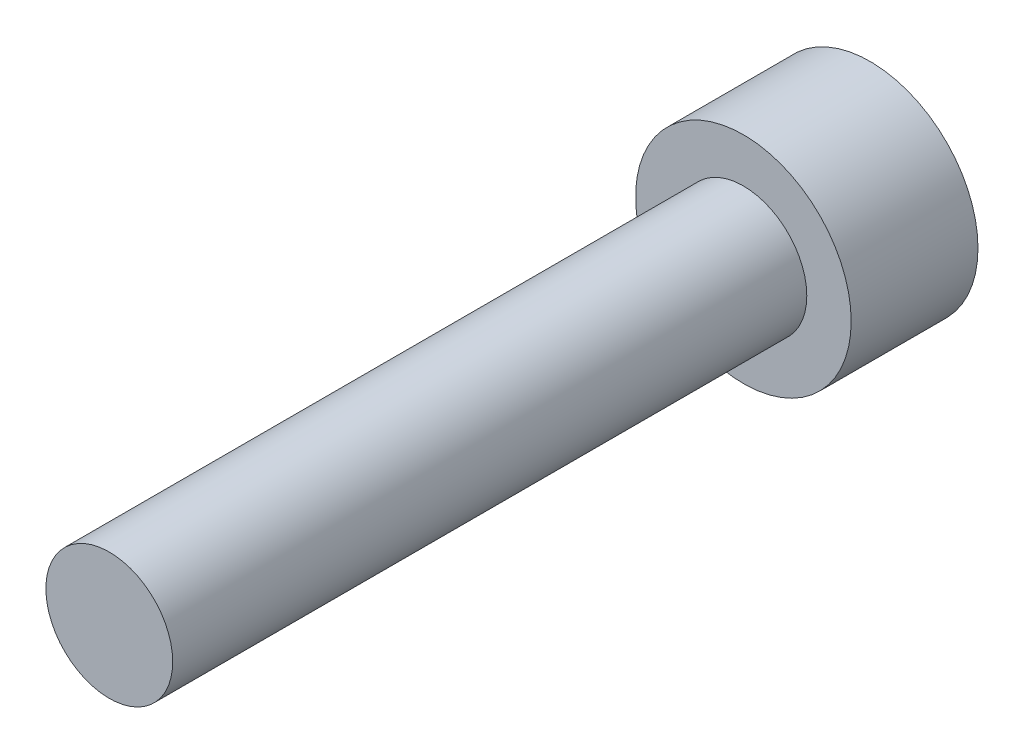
from build123d import *

# Parameters (mm, degrees)
HEX_2_DEPTH = 4


with BuildPart() as part:
    # Sketch6 → Revolve1 (revolve)
    with BuildSketch(Plane(origin=(0, 0, 0), x_dir=(0, 0, -1), z_dir=(1, 0, 0)), mode=Mode.PRIVATE) as revolve1_sk:
        Polygon((-25, 0), (-25, -2.5), (0, -2.5), (0, -4.25), (5, -4.25), (5, 0), align=None)
    revolve(revolve1_sk.sketch.rotate(Axis((0, 0, 25), (0, 0, -1)), 270), axis=Axis((0, 0, 25), (0, 0, -1)))

    # Sketch7 → HEX 2 (cut)
    with BuildSketch(Plane(origin=(0, 0, -5), x_dir=(-1, 0, 0), z_dir=(0, 0, -1))):
        Polygon((-2, 1.154700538), (-2, -1.154700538), (0, -2.309401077), (2, -1.154700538), (2, 1.154700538), (0, 2.309401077), align=None)
    extrude(amount=-HEX_2_DEPTH, mode=Mode.SUBTRACT)


solid = part.part
